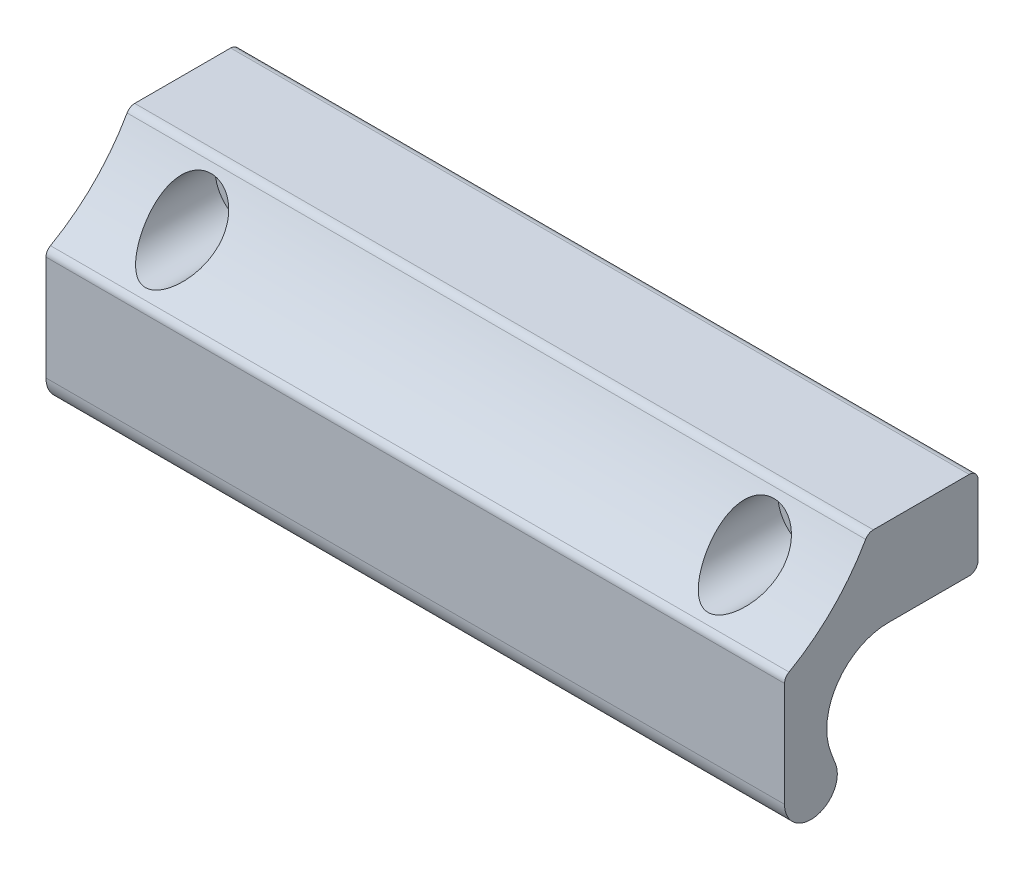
ISO-10303-21;
HEADER;
FILE_DESCRIPTION(('STEP AP214'),'2;1');
FILE_NAME('part.step','',(''),(''),'','','');
FILE_SCHEMA(('AUTOMOTIVE_DESIGN { 1 0 10303 214 1 1 1 1 }'));
ENDSEC;
DATA;
#1=APPLICATION_CONTEXT('core data for automotive mechanical design processes');
#2=APPLICATION_PROTOCOL_DEFINITION('international standard','automotive_design',2000,#1);
#3=PRODUCT_CONTEXT('',#1,'mechanical');
#4=PRODUCT('Part','Part','',(#3));
#5=PRODUCT_RELATED_PRODUCT_CATEGORY('part','',(#4));
#6=PRODUCT_DEFINITION_FORMATION('','',#4);
#7=PRODUCT_DEFINITION_CONTEXT('part definition',#1,'design');
#8=PRODUCT_DEFINITION('design','',#6,#7);
#9=PRODUCT_DEFINITION_SHAPE('','',#8);
#10=(LENGTH_UNIT() NAMED_UNIT(*) SI_UNIT(.MILLI.,.METRE.));
#11=(NAMED_UNIT(*) PLANE_ANGLE_UNIT() SI_UNIT($,.RADIAN.));
#12=(NAMED_UNIT(*) SI_UNIT($,.STERADIAN.) SOLID_ANGLE_UNIT());
#13=UNCERTAINTY_MEASURE_WITH_UNIT(LENGTH_MEASURE(1.E-05),#10,'distance_accuracy_value','');
#14=(GEOMETRIC_REPRESENTATION_CONTEXT(3) GLOBAL_UNCERTAINTY_ASSIGNED_CONTEXT((#13)) GLOBAL_UNIT_ASSIGNED_CONTEXT((#10,
#11,#12)) REPRESENTATION_CONTEXT('',''));
#15=CARTESIAN_POINT('',(0.,0.,0.));
#16=DIRECTION('',(0.,0.,1.));
#17=DIRECTION('',(1.,0.,0.));
#18=AXIS2_PLACEMENT_3D('',#15,#16,#17);
#19=CARTESIAN_POINT('',(-10.,15.8043402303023,32.8043402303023));
#20=DIRECTION('',(1.,0.,0.));
#21=DIRECTION('',(0.,1.,0.));
#22=AXIS2_PLACEMENT_3D('',#19,#20,#21);
#23=CYLINDRICAL_SURFACE('',#22,23.);
#24=CARTESIAN_POINT('',(67.75,0.,16.094378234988));
#25=CARTESIAN_POINT('',(67.7500006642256,-0.150169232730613,16.236409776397));
#26=CARTESIAN_POINT('',(67.7409857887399,-0.29845859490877,16.3805076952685));
#27=CARTESIAN_POINT('',(67.7061827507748,-0.590181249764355,16.6716960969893));
#28=CARTESIAN_POINT('',(67.6803814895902,-0.733610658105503,16.8187888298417));
#29=CARTESIAN_POINT('',(67.6128217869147,-1.01544237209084,17.1155863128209));
#30=CARTESIAN_POINT('',(67.5709823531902,-1.15381519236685,17.2653005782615));
#31=CARTESIAN_POINT('',(67.4720695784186,-1.42405592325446,17.5654707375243));
#32=CARTESIAN_POINT('',(67.4150003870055,-1.55592559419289,17.7159264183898));
#33=CARTESIAN_POINT('',(67.2849647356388,-1.81460439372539,18.0187712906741));
#34=CARTESIAN_POINT('',(67.2117670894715,-1.9413043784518,18.1711545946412));
#35=CARTESIAN_POINT('',(67.0498715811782,-2.1868769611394,18.4741574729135));
#36=CARTESIAN_POINT('',(66.9611662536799,-2.30574575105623,18.6247761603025));
#37=CARTESIAN_POINT('',(66.7681376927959,-2.53420019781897,18.9215160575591));
#38=CARTESIAN_POINT('',(66.6638971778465,-2.64383047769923,19.067656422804));
#39=CARTESIAN_POINT('',(66.4382918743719,-2.853229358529,19.3534526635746));
#40=CARTESIAN_POINT('',(66.316948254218,-2.95300989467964,19.493116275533));
#41=CARTESIAN_POINT('',(66.0789502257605,-3.12374564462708,19.7373761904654));
#42=CARTESIAN_POINT('',(65.965498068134,-3.19663498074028,19.8437139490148));
#43=CARTESIAN_POINT('',(65.7241156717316,-3.33304729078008,20.045999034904));
#44=CARTESIAN_POINT('',(65.5961684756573,-3.39655909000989,20.1419339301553));
#45=CARTESIAN_POINT('',(65.3222714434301,-3.51232726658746,20.3192407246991));
#46=CARTESIAN_POINT('',(65.1760841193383,-3.56440400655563,20.4003772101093));
#47=CARTESIAN_POINT('',(64.9451529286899,-3.62981593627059,20.5033135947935));
#48=CARTESIAN_POINT('',(64.8663403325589,-3.64948596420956,20.5344702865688));
#49=CARTESIAN_POINT('',(64.7051956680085,-3.68401760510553,20.5893923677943));
#50=CARTESIAN_POINT('',(64.6228662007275,-3.69888270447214,20.6131631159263));
#51=CARTESIAN_POINT('',(64.4293848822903,-3.72697994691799,20.658210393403));
#52=CARTESIAN_POINT('',(64.3172035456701,-3.73828046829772,20.6764343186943));
#53=CARTESIAN_POINT('',(64.0908651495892,-3.75060996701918,20.6963234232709));
#54=CARTESIAN_POINT('',(63.9767093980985,-3.75164550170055,20.6979991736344));
#55=CARTESIAN_POINT('',(63.7498794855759,-3.74336926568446,20.6846411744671));
#56=CARTESIAN_POINT('',(63.6372042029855,-3.73406584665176,20.669620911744));
#57=CARTESIAN_POINT('',(63.4161596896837,-3.70595298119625,20.6244737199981));
#58=CARTESIAN_POINT('',(63.307794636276,-3.68713454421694,20.5943325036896));
#59=CARTESIAN_POINT('',(63.0562251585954,-3.6323825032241,20.5072938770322));
#60=CARTESIAN_POINT('',(62.9158969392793,-3.59263719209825,20.4445472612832));
#61=CARTESIAN_POINT('',(62.6486494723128,-3.50092089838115,20.3017774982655));
#62=CARTESIAN_POINT('',(62.5217650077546,-3.44891927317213,20.2217110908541));
#63=CARTESIAN_POINT('',(62.303724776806,-3.34616134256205,20.0659999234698));
#64=CARTESIAN_POINT('',(62.2103375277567,-3.29701024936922,19.9923557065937));
#65=CARTESIAN_POINT('',(62.0314834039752,-3.19345122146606,19.839292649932));
#66=CARTESIAN_POINT('',(61.946021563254,-3.13903998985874,19.7598701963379));
#67=CARTESIAN_POINT('',(61.7823320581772,-3.02562036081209,19.5966727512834));
#68=CARTESIAN_POINT('',(61.704116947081,-2.96660430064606,19.5128905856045));
#69=CARTESIAN_POINT('',(61.554530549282,-2.84455534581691,19.3421814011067));
#70=CARTESIAN_POINT('',(61.4831614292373,-2.7815211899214,19.255253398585));
#71=CARTESIAN_POINT('',(61.3069800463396,-2.61388606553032,19.0275868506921));
#72=CARTESIAN_POINT('',(61.2070155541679,-2.5065324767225,18.8851063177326));
#73=CARTESIAN_POINT('',(61.022064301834,-2.28371602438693,18.5967547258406));
#74=CARTESIAN_POINT('',(60.9370856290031,-2.16824882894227,18.4508818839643));
#75=CARTESIAN_POINT('',(60.7815301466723,-1.92982538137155,18.1573214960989));
#76=CARTESIAN_POINT('',(60.710967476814,-1.80686192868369,18.0096323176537));
#77=CARTESIAN_POINT('',(60.5842889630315,-1.55415187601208,17.7139267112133));
#78=CARTESIAN_POINT('',(60.5281703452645,-1.42440658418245,17.565910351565));
#79=CARTESIAN_POINT('',(60.4294697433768,-1.15535678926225,17.2669625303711));
#80=CARTESIAN_POINT('',(60.3872582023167,-1.01589497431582,17.116049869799));
#81=CARTESIAN_POINT('',(60.3190319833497,-0.731044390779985,16.8160994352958));
#82=CARTESIAN_POINT('',(60.293019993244,-0.585654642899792,16.667061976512));
#83=CARTESIAN_POINT('',(60.25828003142,-0.290055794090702,16.3722410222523));
#84=CARTESIAN_POINT('',(60.2495221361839,-0.139855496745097,16.2264523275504));
#85=CARTESIAN_POINT('',(60.2505179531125,0.164377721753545,15.9391279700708));
#86=CARTESIAN_POINT('',(60.2602636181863,0.31840894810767,15.7975904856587));
#87=CARTESIAN_POINT('',(60.3079126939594,0.692581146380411,15.4630412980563));
#88=CARTESIAN_POINT('',(60.3557102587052,0.91397103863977,15.2726783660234));
#89=CARTESIAN_POINT('',(60.495799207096,1.35518812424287,14.9073062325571));
#90=CARTESIAN_POINT('',(60.5880264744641,1.57501710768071,14.7322753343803));
#91=CARTESIAN_POINT('',(60.7991197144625,1.96367364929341,14.4335970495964));
#92=CARTESIAN_POINT('',(60.9096629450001,2.13429131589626,14.3064889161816));
#93=CARTESIAN_POINT('',(61.1001727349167,2.37997450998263,14.1282393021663));
#94=CARTESIAN_POINT('',(61.1678322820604,2.46019965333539,14.0708656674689));
#95=CARTESIAN_POINT('',(61.3113580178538,2.616281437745,13.9606622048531));
#96=CARTESIAN_POINT('',(61.3872204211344,2.69214006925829,13.907830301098));
#97=CARTESIAN_POINT('',(61.5477452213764,2.83917333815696,13.806643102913));
#98=CARTESIAN_POINT('',(61.6324832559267,2.91029755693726,13.758334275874));
#99=CARTESIAN_POINT('',(61.8097619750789,3.04594886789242,13.6672003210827));
#100=CARTESIAN_POINT('',(61.902298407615,3.11047951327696,13.6243722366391));
#101=CARTESIAN_POINT('',(62.0946077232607,3.23185755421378,13.5445905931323));
#102=CARTESIAN_POINT('',(62.1943773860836,3.28870833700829,13.5076344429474));
#103=CARTESIAN_POINT('',(62.4004020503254,3.39369189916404,13.4399472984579));
#104=CARTESIAN_POINT('',(62.5066557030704,3.44182648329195,13.4092150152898));
#105=CARTESIAN_POINT('',(62.7083226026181,3.52193401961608,13.3584049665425));
#106=CARTESIAN_POINT('',(62.8029778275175,3.55524764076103,13.3374209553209));
#107=CARTESIAN_POINT('',(62.9955300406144,3.61437106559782,13.3003439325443));
#108=CARTESIAN_POINT('',(63.0934265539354,3.64018196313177,13.2842502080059));
#109=CARTESIAN_POINT('',(63.2915997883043,3.68387839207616,13.2570880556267));
#110=CARTESIAN_POINT('',(63.3918751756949,3.70176825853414,13.2460168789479));
#111=CARTESIAN_POINT('',(63.5939747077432,3.72934871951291,13.2289770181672));
#112=CARTESIAN_POINT('',(63.6957987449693,3.73903988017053,13.2230079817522));
#113=CARTESIAN_POINT('',(63.8896006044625,3.74949905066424,13.2165676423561));
#114=CARTESIAN_POINT('',(63.9815192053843,3.751079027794,13.2155960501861));
#115=CARTESIAN_POINT('',(64.1652063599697,3.7474856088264,13.2178075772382));
#116=CARTESIAN_POINT('',(64.2569748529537,3.74230994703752,13.2209920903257));
#117=CARTESIAN_POINT('',(64.439597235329,3.72527248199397,13.2314961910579));
#118=CARTESIAN_POINT('',(64.5304516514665,3.71341478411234,13.2388132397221));
#119=CARTESIAN_POINT('',(64.7106535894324,3.68318293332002,13.2575283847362));
#120=CARTESIAN_POINT('',(64.8000005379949,3.66480635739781,13.2689279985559));
#121=CARTESIAN_POINT('',(65.0615737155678,3.60101108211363,13.3086664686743));
#122=CARTESIAN_POINT('',(65.2308516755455,3.54658365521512,13.3427515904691));
#123=CARTESIAN_POINT('',(65.5568664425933,3.41607587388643,13.4255677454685));
#124=CARTESIAN_POINT('',(65.7136012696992,3.33999210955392,13.4743010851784));
#125=CARTESIAN_POINT('',(66.0192314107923,3.16508567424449,13.5881842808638));
#126=CARTESIAN_POINT('',(66.1672994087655,3.0652888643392,13.6540540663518));
#127=CARTESIAN_POINT('',(66.443829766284,2.84973334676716,13.7992083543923));
#128=CARTESIAN_POINT('',(66.5722875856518,2.73397095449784,13.8784959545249));
#129=CARTESIAN_POINT('',(66.8221710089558,2.47661423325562,14.0586987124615));
#130=CARTESIAN_POINT('',(66.9410681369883,2.33358067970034,14.1610543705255));
#131=CARTESIAN_POINT('',(67.1530779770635,2.03807613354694,14.378170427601));
#132=CARTESIAN_POINT('',(67.2461621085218,1.8855949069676,14.4929443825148));
#133=CARTESIAN_POINT('',(67.4441188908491,1.50504726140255,14.7873723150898));
#134=CARTESIAN_POINT('',(67.5350714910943,1.27416834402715,14.9727785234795));
#135=CARTESIAN_POINT('',(67.668890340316,0.812200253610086,15.3593785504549));
#136=CARTESIAN_POINT('',(67.7117581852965,0.581111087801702,15.5605718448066));
#137=CARTESIAN_POINT('',(67.7389347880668,0.293978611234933,15.8209607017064));
#138=CARTESIAN_POINT('',(67.7431071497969,0.234797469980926,15.8751995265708));
#139=CARTESIAN_POINT('',(67.7486383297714,0.116983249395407,15.9843147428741));
#140=CARTESIAN_POINT('',(67.7499997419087,0.0583497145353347,16.0391904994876));
#141=CARTESIAN_POINT('',(67.75,0.,16.094378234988));
#142=B_SPLINE_CURVE_WITH_KNOTS('',3,(#24,#25,#26,#27,#28,#29,#30,#31,#32,#33,#34,#35,#36,#37,
#38,#39,#40,#41,#42,#43,#44,#45,#46,#47,#48,#49,#50,#51,#52,#53,#54,#55,#56,#57,#58,#59,#60,#61,
#62,#63,#64,#65,#66,#67,#68,#69,#70,#71,#72,#73,#74,#75,#76,#77,#78,#79,#80,#81,#82,#83,#84,#85,
#86,#87,#88,#89,#90,#91,#92,#93,#94,#95,#96,#97,#98,#99,#100,#101,#102,#103,#104,#105,#106,#107,
#108,#109,#110,#111,#112,#113,#114,#115,#116,#117,#118,#119,#120,#121,#122,#123,#124,#125,#126,
#127,#128,#129,#130,#131,#132,#133,#134,#135,#136,#137,#138,#139,#140,#141),.UNSPECIFIED.,.T.,
.F.,(4,2,2,2,2,2,2,2,2,2,2,2,2,2,2,2,2,2,2,2,2,2,2,2,2,2,2,2,2,2,2,2,2,2,2,2,2,2,2,2,2,2,2,2,2,
2,2,2,2,2,2,2,2,2,2,2,2,2,4),(0.,0.620002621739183,1.24048962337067,1.8641522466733,
2.48764511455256,3.12073548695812,3.75413147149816,4.38426801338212,5.01363137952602,
5.52787354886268,6.04272365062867,6.5651600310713,6.82572511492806,7.08610070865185,
7.4271175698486,7.76791657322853,8.10844048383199,8.44928675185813,8.92293422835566,
9.39777869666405,9.78331644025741,10.1690974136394,10.5555346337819,10.9420937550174,
11.5546950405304,12.1676259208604,12.781155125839,13.3945664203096,14.0231985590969,
14.6519349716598,15.2795800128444,15.9069521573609,16.7911651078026,17.6741058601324,
18.3902630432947,18.7487042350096,19.1069807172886,19.4686065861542,19.8300365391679,
20.1913065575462,20.5525016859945,20.8596314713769,21.1667164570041,21.4736331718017,
21.7805286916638,22.0560044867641,22.3315726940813,22.606971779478,22.8824733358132,
23.422984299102,23.9635804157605,24.5321944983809,25.100940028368,25.7354158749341,
26.370591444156,27.2948858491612,28.2191495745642,28.4602802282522,28.7011882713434),.UNSPECIFIED.);
#143=CARTESIAN_POINT('',(67.75,0.,16.094378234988));
#144=VERTEX_POINT('',#143);
#145=EDGE_CURVE('E18',#144,#144,#142,.T.);
#146=ORIENTED_EDGE('',*,*,#145,.T.);
#147=EDGE_LOOP('',(#146));
#148=FACE_BOUND('',#147,.T.);
#149=CARTESIAN_POINT('',(3.75,0.,16.094378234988));
#150=CARTESIAN_POINT('',(3.75000066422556,-0.150169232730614,16.236409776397));
#151=CARTESIAN_POINT('',(3.74098578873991,-0.298458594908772,16.3805076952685));
#152=CARTESIAN_POINT('',(3.70618275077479,-0.590181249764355,16.6716960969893));
#153=CARTESIAN_POINT('',(3.68038148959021,-0.7336106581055,16.8187888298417));
#154=CARTESIAN_POINT('',(3.61282178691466,-1.01544237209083,17.1155863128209));
#155=CARTESIAN_POINT('',(3.57098235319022,-1.15381519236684,17.2653005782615));
#156=CARTESIAN_POINT('',(3.47206957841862,-1.42405592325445,17.5654707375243));
#157=CARTESIAN_POINT('',(3.41500038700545,-1.55592559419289,17.7159264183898));
#158=CARTESIAN_POINT('',(3.28496473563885,-1.81460439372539,18.0187712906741));
#159=CARTESIAN_POINT('',(3.21176708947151,-1.9413043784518,18.1711545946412));
#160=CARTESIAN_POINT('',(3.04987158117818,-2.1868769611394,18.4741574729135));
#161=CARTESIAN_POINT('',(2.96116625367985,-2.30574575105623,18.6247761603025));
#162=CARTESIAN_POINT('',(2.76813769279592,-2.53420019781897,18.9215160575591));
#163=CARTESIAN_POINT('',(2.66389717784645,-2.64383047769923,19.067656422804));
#164=CARTESIAN_POINT('',(2.43829187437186,-2.853229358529,19.3534526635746));
#165=CARTESIAN_POINT('',(2.31694825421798,-2.95300989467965,19.493116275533));
#166=CARTESIAN_POINT('',(2.07895022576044,-3.12374564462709,19.7373761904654));
#167=CARTESIAN_POINT('',(1.965498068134,-3.19663498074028,19.8437139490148));
#168=CARTESIAN_POINT('',(1.72411567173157,-3.33304729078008,20.045999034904));
#169=CARTESIAN_POINT('',(1.59616847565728,-3.3965590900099,20.1419339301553));
#170=CARTESIAN_POINT('',(1.32227144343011,-3.51232726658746,20.3192407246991));
#171=CARTESIAN_POINT('',(1.1760841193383,-3.56440400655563,20.4003772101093));
#172=CARTESIAN_POINT('',(0.945152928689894,-3.62981593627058,20.5033135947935));
#173=CARTESIAN_POINT('',(0.866340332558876,-3.64948596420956,20.5344702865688));
#174=CARTESIAN_POINT('',(0.705195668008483,-3.68401760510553,20.5893923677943));
#175=CARTESIAN_POINT('',(0.622866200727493,-3.69888270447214,20.6131631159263));
#176=CARTESIAN_POINT('',(0.429384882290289,-3.72697994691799,20.658210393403));
#177=CARTESIAN_POINT('',(0.317203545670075,-3.73828046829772,20.6764343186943));
#178=CARTESIAN_POINT('',(0.0908651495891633,-3.75060996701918,20.6963234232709));
#179=CARTESIAN_POINT('',(-0.0232906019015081,-3.75164550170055,20.6979991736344));
#180=CARTESIAN_POINT('',(-0.250120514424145,-3.74336926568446,20.6846411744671));
#181=CARTESIAN_POINT('',(-0.362795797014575,-3.73406584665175,20.669620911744));
#182=CARTESIAN_POINT('',(-0.583840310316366,-3.70595298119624,20.6244737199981));
#183=CARTESIAN_POINT('',(-0.692205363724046,-3.68713454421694,20.5943325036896));
#184=CARTESIAN_POINT('',(-0.943774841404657,-3.63238250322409,20.5072938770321));
#185=CARTESIAN_POINT('',(-1.08410306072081,-3.59263719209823,20.4445472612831));
#186=CARTESIAN_POINT('',(-1.35135052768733,-3.50092089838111,20.3017774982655));
#187=CARTESIAN_POINT('',(-1.47823499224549,-3.44891927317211,20.221711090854));
#188=CARTESIAN_POINT('',(-1.6962752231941,-3.34616134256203,20.0659999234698));
#189=CARTESIAN_POINT('',(-1.7896624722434,-3.29701024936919,19.9923557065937));
#190=CARTESIAN_POINT('',(-1.9685165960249,-3.19345122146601,19.839292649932));
#191=CARTESIAN_POINT('',(-2.0539784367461,-3.1390399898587,19.7598701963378));
#192=CARTESIAN_POINT('',(-2.21766794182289,-3.02562036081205,19.5966727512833));
#193=CARTESIAN_POINT('',(-2.29588305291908,-2.96660430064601,19.5128905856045));
#194=CARTESIAN_POINT('',(-2.44546945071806,-2.84455534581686,19.3421814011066));
#195=CARTESIAN_POINT('',(-2.51683857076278,-2.78152118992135,19.255253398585));
#196=CARTESIAN_POINT('',(-2.69301995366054,-2.61388606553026,19.0275868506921));
#197=CARTESIAN_POINT('',(-2.79298444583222,-2.50653247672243,18.8851063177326));
#198=CARTESIAN_POINT('',(-2.97793569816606,-2.28371602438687,18.5967547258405));
#199=CARTESIAN_POINT('',(-3.0629143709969,-2.1682488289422,18.4508818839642));
#200=CARTESIAN_POINT('',(-3.21846985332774,-1.92982538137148,18.1573214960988));
#201=CARTESIAN_POINT('',(-3.28903252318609,-1.80686192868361,18.0096323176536));
#202=CARTESIAN_POINT('',(-3.41571103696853,-1.554151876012,17.7139267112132));
#203=CARTESIAN_POINT('',(-3.47182965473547,-1.42440658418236,17.5659103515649));
#204=CARTESIAN_POINT('',(-3.57053025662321,-1.15535678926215,17.266962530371));
#205=CARTESIAN_POINT('',(-3.61274179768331,-1.01589497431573,17.1160498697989));
#206=CARTESIAN_POINT('',(-3.68096801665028,-0.731044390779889,16.8160994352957));
#207=CARTESIAN_POINT('',(-3.70698000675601,-0.585654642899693,16.6670619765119));
#208=CARTESIAN_POINT('',(-3.74171996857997,-0.290055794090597,16.3722410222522));
#209=CARTESIAN_POINT('',(-3.75047786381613,-0.13985549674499,16.2264523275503));
#210=CARTESIAN_POINT('',(-3.74948204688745,0.164377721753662,15.9391279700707));
#211=CARTESIAN_POINT('',(-3.73973638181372,0.318408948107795,15.7975904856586));
#212=CARTESIAN_POINT('',(-3.69208730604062,0.692581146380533,15.4630412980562));
#213=CARTESIAN_POINT('',(-3.64428974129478,0.913971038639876,15.2726783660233));
#214=CARTESIAN_POINT('',(-3.50420079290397,1.35518812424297,14.907306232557));
#215=CARTESIAN_POINT('',(-3.41197352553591,1.57501710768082,14.7322753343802));
#216=CARTESIAN_POINT('',(-3.20088028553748,1.9636736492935,14.4335970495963));
#217=CARTESIAN_POINT('',(-3.09033705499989,2.13429131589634,14.3064889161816));
#218=CARTESIAN_POINT('',(-2.89982726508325,2.3799745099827,14.1282393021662));
#219=CARTESIAN_POINT('',(-2.83216771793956,2.46019965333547,14.0708656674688));
#220=CARTESIAN_POINT('',(-2.68864198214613,2.61628143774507,13.9606622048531));
#221=CARTESIAN_POINT('',(-2.61277957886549,2.69214006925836,13.9078303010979));
#222=CARTESIAN_POINT('',(-2.45225477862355,2.83917333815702,13.806643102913));
#223=CARTESIAN_POINT('',(-2.36751674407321,2.91029755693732,13.758334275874));
#224=CARTESIAN_POINT('',(-2.19023802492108,3.04594886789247,13.6672003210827));
#225=CARTESIAN_POINT('',(-2.09770159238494,3.11047951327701,13.624372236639));
#226=CARTESIAN_POINT('',(-1.90539227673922,3.23185755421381,13.5445905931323));
#227=CARTESIAN_POINT('',(-1.80562261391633,3.28870833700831,13.5076344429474));
#228=CARTESIAN_POINT('',(-1.59959794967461,3.39369189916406,13.4399472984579));
#229=CARTESIAN_POINT('',(-1.49334429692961,3.44182648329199,13.4092150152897));
#230=CARTESIAN_POINT('',(-1.29167739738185,3.52193401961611,13.3584049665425));
#231=CARTESIAN_POINT('',(-1.19702217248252,3.55524764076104,13.3374209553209));
#232=CARTESIAN_POINT('',(-1.00446995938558,3.61437106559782,13.3003439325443));
#233=CARTESIAN_POINT('',(-0.906573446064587,3.64018196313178,13.2842502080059));
#234=CARTESIAN_POINT('',(-0.708400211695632,3.68387839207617,13.2570880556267));
#235=CARTESIAN_POINT('',(-0.608124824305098,3.70176825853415,13.2460168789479));
#236=CARTESIAN_POINT('',(-0.4060252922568,3.72934871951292,13.2289770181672));
#237=CARTESIAN_POINT('',(-0.304201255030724,3.73903988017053,13.2230079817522));
#238=CARTESIAN_POINT('',(-0.110399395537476,3.74949905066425,13.2165676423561));
#239=CARTESIAN_POINT('',(-0.018480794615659,3.751079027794,13.2155960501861));
#240=CARTESIAN_POINT('',(0.165206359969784,3.74748560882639,13.2178075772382));
#241=CARTESIAN_POINT('',(0.256974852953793,3.74230994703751,13.2209920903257));
#242=CARTESIAN_POINT('',(0.439597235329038,3.72527248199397,13.2314961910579));
#243=CARTESIAN_POINT('',(0.530451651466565,3.71341478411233,13.2388132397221));
#244=CARTESIAN_POINT('',(0.710653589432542,3.68318293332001,13.2575283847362));
#245=CARTESIAN_POINT('',(0.800000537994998,3.66480635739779,13.2689279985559));
#246=CARTESIAN_POINT('',(1.06157371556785,3.60101108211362,13.3086664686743));
#247=CARTESIAN_POINT('',(1.23085167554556,3.54658365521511,13.3427515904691));
#248=CARTESIAN_POINT('',(1.55686644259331,3.4160758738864,13.4255677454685));
#249=CARTESIAN_POINT('',(1.71360126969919,3.33999210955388,13.4743010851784));
#250=CARTESIAN_POINT('',(2.01923141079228,3.16508567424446,13.5881842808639));
#251=CARTESIAN_POINT('',(2.1672994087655,3.06528886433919,13.6540540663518));
#252=CARTESIAN_POINT('',(2.44382976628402,2.84973334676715,13.7992083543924));
#253=CARTESIAN_POINT('',(2.57228758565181,2.7339709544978,13.878495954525));
#254=CARTESIAN_POINT('',(2.82217100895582,2.47661423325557,14.0586987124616));
#255=CARTESIAN_POINT('',(2.94106813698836,2.3335806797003,14.1610543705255));
#256=CARTESIAN_POINT('',(3.15307797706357,2.03807613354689,14.378170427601));
#257=CARTESIAN_POINT('',(3.24616210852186,1.88559490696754,14.4929443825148));
#258=CARTESIAN_POINT('',(3.44411889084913,1.50504726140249,14.7873723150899));
#259=CARTESIAN_POINT('',(3.53507149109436,1.27416834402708,14.9727785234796));
#260=CARTESIAN_POINT('',(3.66889034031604,0.81220025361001,15.3593785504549));
#261=CARTESIAN_POINT('',(3.71175818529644,0.581111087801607,15.5605718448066));
#262=CARTESIAN_POINT('',(3.73893478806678,0.293978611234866,15.8209607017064));
#263=CARTESIAN_POINT('',(3.74310714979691,0.234797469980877,15.8751995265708));
#264=CARTESIAN_POINT('',(3.74863832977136,0.116983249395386,15.9843147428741));
#265=CARTESIAN_POINT('',(3.7499997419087,0.0583497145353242,16.0391904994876));
#266=CARTESIAN_POINT('',(3.75,0.,16.094378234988));
#267=B_SPLINE_CURVE_WITH_KNOTS('',3,(#149,#150,#151,#152,#153,#154,#155,#156,#157,#158,#159,
#160,#161,#162,#163,#164,#165,#166,#167,#168,#169,#170,#171,#172,#173,#174,#175,#176,#177,#178,
#179,#180,#181,#182,#183,#184,#185,#186,#187,#188,#189,#190,#191,#192,#193,#194,#195,#196,#197,
#198,#199,#200,#201,#202,#203,#204,#205,#206,#207,#208,#209,#210,#211,#212,#213,#214,#215,#216,
#217,#218,#219,#220,#221,#222,#223,#224,#225,#226,#227,#228,#229,#230,#231,#232,#233,#234,#235,
#236,#237,#238,#239,#240,#241,#242,#243,#244,#245,#246,#247,#248,#249,#250,#251,#252,#253,#254,
#255,#256,#257,#258,#259,#260,#261,#262,#263,#264,#265,#266),.UNSPECIFIED.,.T.,.F.,(4,2,2,2,2,2,
2,2,2,2,2,2,2,2,2,2,2,2,2,2,2,2,2,2,2,2,2,2,2,2,2,2,2,2,2,2,2,2,2,2,2,2,2,2,2,2,2,2,2,2,2,2,2,2,
2,2,2,2,4),(0.,0.62000262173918,1.24048962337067,1.8641522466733,2.48764511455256,
3.12073548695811,3.75413147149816,4.38426801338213,5.01363137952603,5.52787354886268,
6.04272365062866,6.5651600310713,6.82572511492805,7.08610070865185,7.42711756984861,
7.76791657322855,8.10844048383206,8.44928675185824,8.92293422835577,9.39777869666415,
9.78331644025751,10.1690974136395,10.555534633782,10.9420937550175,11.5546950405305,
12.1676259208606,12.7811551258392,13.3945664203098,14.0231985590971,14.65193497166,
15.2795800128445,15.9069521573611,16.7911651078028,17.6741058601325,18.3902630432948,
18.7487042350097,19.1069807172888,19.4686065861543,19.830036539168,20.1913065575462,
20.5525016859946,20.859631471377,21.1667164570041,21.4736331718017,21.7805286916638,
22.0560044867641,22.3315726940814,22.6069717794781,22.8824733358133,23.4229842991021,
23.9635804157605,24.532194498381,25.1009400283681,25.7354158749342,26.3705914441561,
27.2948858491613,28.2191495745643,28.4602802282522,28.7011882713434),.UNSPECIFIED.);
#268=CARTESIAN_POINT('',(3.75,0.,16.094378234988));
#269=VERTEX_POINT('',#268);
#270=EDGE_CURVE('E131',#269,#269,#267,.T.);
#271=ORIENTED_EDGE('',*,*,#270,.T.);
#272=EDGE_LOOP('',(#271));
#273=FACE_BOUND('',#272,.T.);
#274=DIRECTION('',(1.,0.,0.));
#275=VECTOR('',#274,1.);
#276=CARTESIAN_POINT('',(-10.,-4.22133100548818,21.4918475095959));
#277=LINE('',#276,#275);
#278=CARTESIAN_POINT('',(-10.,-4.22133100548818,21.4918475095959));
#279=VERTEX_POINT('',#278);
#280=CARTESIAN_POINT('',(74.,-4.22133100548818,21.4918475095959));
#281=VERTEX_POINT('',#280);
#282=EDGE_CURVE('E127',#279,#281,#277,.T.);
#283=ORIENTED_EDGE('',*,*,#282,.T.);
#284=CARTESIAN_POINT('',(74.,15.8043402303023,32.8043402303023));
#285=DIRECTION('',(1.,0.,0.));
#286=DIRECTION('',(0.,-1.,0.));
#287=AXIS2_PLACEMENT_3D('',#284,#285,#286);
#288=CIRCLE('',#287,23.);
#289=CARTESIAN_POINT('',(74.,4.49184750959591,12.7786689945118));
#290=VERTEX_POINT('',#289);
#291=EDGE_CURVE('E121',#281,#290,#288,.T.);
#292=ORIENTED_EDGE('',*,*,#291,.T.);
#293=DIRECTION('',(1.,0.,0.));
#294=VECTOR('',#293,1.);
#295=CARTESIAN_POINT('',(-10.,4.49184750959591,12.7786689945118));
#296=LINE('',#295,#294);
#297=CARTESIAN_POINT('',(-10.,4.49184750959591,12.7786689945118));
#298=VERTEX_POINT('',#297);
#299=EDGE_CURVE('E9',#298,#290,#296,.T.);
#300=ORIENTED_EDGE('',*,*,#299,.F.);
#301=CARTESIAN_POINT('',(-10.,15.8043402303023,32.8043402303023));
#302=DIRECTION('',(1.,0.,0.));
#303=DIRECTION('',(0.,-1.,0.));
#304=AXIS2_PLACEMENT_3D('',#301,#302,#303);
#305=CIRCLE('',#304,23.);
#306=EDGE_CURVE('E162',#279,#298,#305,.T.);
#307=ORIENTED_EDGE('',*,*,#306,.F.);
#308=EDGE_LOOP('',(#283,#292,#300,#307));
#309=FACE_BOUND('',#308,.T.);
#310=ADVANCED_FACE('F14',(#148,#273,#309),#23,.F.);
#311=CARTESIAN_POINT('',(-10.,4.,11.907987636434));
#312=DIRECTION('',(1.,0.,0.));
#313=DIRECTION('',(0.,1.,0.));
#314=AXIS2_PLACEMENT_3D('',#311,#312,#313);
#315=CYLINDRICAL_SURFACE('',#314,1.);
#316=ORIENTED_EDGE('',*,*,#299,.T.);
#317=CARTESIAN_POINT('',(74.,4.,11.907987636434));
#318=DIRECTION('',(-1.,0.,0.));
#319=DIRECTION('',(0.,-1.,0.));
#320=AXIS2_PLACEMENT_3D('',#317,#318,#319);
#321=CIRCLE('',#320,1.);
#322=CARTESIAN_POINT('',(74.,5.,11.907987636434));
#323=VERTEX_POINT('',#322);
#324=EDGE_CURVE('E111',#290,#323,#321,.T.);
#325=ORIENTED_EDGE('',*,*,#324,.T.);
#326=DIRECTION('',(1.,0.,0.));
#327=VECTOR('',#326,1.);
#328=CARTESIAN_POINT('',(-10.,5.,11.907987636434));
#329=LINE('',#328,#327);
#330=CARTESIAN_POINT('',(-10.,5.,11.907987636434));
#331=VERTEX_POINT('',#330);
#332=EDGE_CURVE('E27',#331,#323,#329,.T.);
#333=ORIENTED_EDGE('',*,*,#332,.F.);
#334=CARTESIAN_POINT('',(-10.,4.,11.907987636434));
#335=DIRECTION('',(-1.,0.,0.));
#336=DIRECTION('',(0.,-1.,0.));
#337=AXIS2_PLACEMENT_3D('',#334,#335,#336);
#338=CIRCLE('',#337,1.);
#339=EDGE_CURVE('E112',#298,#331,#338,.T.);
#340=ORIENTED_EDGE('',*,*,#339,.F.);
#341=EDGE_LOOP('',(#316,#325,#333,#340));
#342=FACE_BOUND('',#341,.T.);
#343=ADVANCED_FACE('F109',(#342),#315,.T.);
#344=CARTESIAN_POINT('',(-10.,5.,11.907987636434));
#345=DIRECTION('',(0.,-1.,0.));
#346=DIRECTION('',(1.,0.,0.));
#347=AXIS2_PLACEMENT_3D('',#344,#345,#346);
#348=PLANE('',#347);
#349=ORIENTED_EDGE('',*,*,#332,.T.);
#350=DIRECTION('',(0.,0.,-1.));
#351=VECTOR('',#350,1.);
#352=CARTESIAN_POINT('',(74.,5.,11.907987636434));
#353=LINE('',#352,#351);
#354=CARTESIAN_POINT('',(74.,5.,1.));
#355=VERTEX_POINT('',#354);
#356=EDGE_CURVE('E125',#323,#355,#353,.T.);
#357=ORIENTED_EDGE('',*,*,#356,.T.);
#358=DIRECTION('',(1.,0.,0.));
#359=VECTOR('',#358,1.);
#360=CARTESIAN_POINT('',(-10.,5.,1.));
#361=LINE('',#360,#359);
#362=CARTESIAN_POINT('',(-10.,5.,1.));
#363=VERTEX_POINT('',#362);
#364=EDGE_CURVE('E200',#363,#355,#361,.T.);
#365=ORIENTED_EDGE('',*,*,#364,.F.);
#366=DIRECTION('',(0.,0.,-1.));
#367=VECTOR('',#366,1.);
#368=CARTESIAN_POINT('',(-10.,5.,11.907987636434));
#369=LINE('',#368,#367);
#370=EDGE_CURVE('E165',#331,#363,#369,.T.);
#371=ORIENTED_EDGE('',*,*,#370,.F.);
#372=EDGE_LOOP('',(#349,#357,#365,#371));
#373=FACE_BOUND('',#372,.T.);
#374=ADVANCED_FACE('F265',(#373),#348,.F.);
#375=CARTESIAN_POINT('',(-10.,4.,1.));
#376=DIRECTION('',(1.,0.,0.));
#377=DIRECTION('',(0.,1.,0.));
#378=AXIS2_PLACEMENT_3D('',#375,#376,#377);
#379=CYLINDRICAL_SURFACE('',#378,1.);
#380=ORIENTED_EDGE('',*,*,#364,.T.);
#381=CARTESIAN_POINT('',(74.,4.,1.));
#382=DIRECTION('',(-1.,0.,0.));
#383=DIRECTION('',(0.,-1.,0.));
#384=AXIS2_PLACEMENT_3D('',#381,#382,#383);
#385=CIRCLE('',#384,1.);
#386=CARTESIAN_POINT('',(74.,4.,0.));
#387=VERTEX_POINT('',#386);
#388=EDGE_CURVE('E136',#355,#387,#385,.T.);
#389=ORIENTED_EDGE('',*,*,#388,.T.);
#390=DIRECTION('',(1.,0.,0.));
#391=VECTOR('',#390,1.);
#392=CARTESIAN_POINT('',(-10.,4.,0.));
#393=LINE('',#392,#391);
#394=CARTESIAN_POINT('',(-10.,4.,0.));
#395=VERTEX_POINT('',#394);
#396=EDGE_CURVE('E198',#395,#387,#393,.T.);
#397=ORIENTED_EDGE('',*,*,#396,.F.);
#398=CARTESIAN_POINT('',(-10.,4.,1.));
#399=DIRECTION('',(-1.,0.,0.));
#400=DIRECTION('',(0.,-1.,0.));
#401=AXIS2_PLACEMENT_3D('',#398,#399,#400);
#402=CIRCLE('',#401,1.);
#403=EDGE_CURVE('E167',#363,#395,#402,.T.);
#404=ORIENTED_EDGE('',*,*,#403,.F.);
#405=EDGE_LOOP('',(#380,#389,#397,#404));
#406=FACE_BOUND('',#405,.T.);
#407=ADVANCED_FACE('F261',(#406),#379,.T.);
#408=CARTESIAN_POINT('',(-10.,4.,0.));
#409=DIRECTION('',(0.,0.,1.));
#410=DIRECTION('',(-1.,0.,0.));
#411=AXIS2_PLACEMENT_3D('',#408,#409,#410);
#412=PLANE('',#411);
#413=CARTESIAN_POINT('',(64.,0.,0.));
#414=DIRECTION('',(0.,0.,-1.));
#415=DIRECTION('',(1.,0.,0.));
#416=AXIS2_PLACEMENT_3D('',#413,#414,#415);
#417=CIRCLE('',#416,2.25);
#418=CARTESIAN_POINT('',(66.25,0.,0.));
#419=VERTEX_POINT('',#418);
#420=EDGE_CURVE('E285',#419,#419,#417,.T.);
#421=ORIENTED_EDGE('',*,*,#420,.F.);
#422=EDGE_LOOP('',(#421));
#423=FACE_BOUND('',#422,.T.);
#424=CARTESIAN_POINT('',(0.,0.,0.));
#425=DIRECTION('',(0.,0.,-1.));
#426=DIRECTION('',(1.,0.,0.));
#427=AXIS2_PLACEMENT_3D('',#424,#425,#426);
#428=CIRCLE('',#427,2.25);
#429=CARTESIAN_POINT('',(2.25,0.,0.));
#430=VERTEX_POINT('',#429);
#431=EDGE_CURVE('E128',#430,#430,#428,.T.);
#432=ORIENTED_EDGE('',*,*,#431,.F.);
#433=EDGE_LOOP('',(#432));
#434=FACE_BOUND('',#433,.T.);
#435=ORIENTED_EDGE('',*,*,#396,.T.);
#436=DIRECTION('',(0.,-1.,0.));
#437=VECTOR('',#436,1.);
#438=CARTESIAN_POINT('',(74.,4.,0.));
#439=LINE('',#438,#437);
#440=CARTESIAN_POINT('',(74.,-4.,0.));
#441=VERTEX_POINT('',#440);
#442=EDGE_CURVE('E139',#387,#441,#439,.T.);
#443=ORIENTED_EDGE('',*,*,#442,.T.);
#444=DIRECTION('',(1.,0.,0.));
#445=VECTOR('',#444,1.);
#446=CARTESIAN_POINT('',(-10.,-4.,0.));
#447=LINE('',#446,#445);
#448=CARTESIAN_POINT('',(-10.,-4.,0.));
#449=VERTEX_POINT('',#448);
#450=EDGE_CURVE('E196',#449,#441,#447,.T.);
#451=ORIENTED_EDGE('',*,*,#450,.F.);
#452=DIRECTION('',(0.,-1.,0.));
#453=VECTOR('',#452,1.);
#454=CARTESIAN_POINT('',(-10.,4.,0.));
#455=LINE('',#454,#453);
#456=EDGE_CURVE('E169',#395,#449,#455,.T.);
#457=ORIENTED_EDGE('',*,*,#456,.F.);
#458=EDGE_LOOP('',(#435,#443,#451,#457));
#459=FACE_BOUND('',#458,.T.);
#460=ADVANCED_FACE('F257',(#423,#434,#459),#412,.F.);
#461=CARTESIAN_POINT('',(-10.,-4.,1.));
#462=DIRECTION('',(1.,0.,0.));
#463=DIRECTION('',(0.,1.,0.));
#464=AXIS2_PLACEMENT_3D('',#461,#462,#463);
#465=CYLINDRICAL_SURFACE('',#464,1.);
#466=ORIENTED_EDGE('',*,*,#450,.T.);
#467=CARTESIAN_POINT('',(74.,-4.,1.));
#468=DIRECTION('',(-1.,0.,0.));
#469=DIRECTION('',(0.,-1.,0.));
#470=AXIS2_PLACEMENT_3D('',#467,#468,#469);
#471=CIRCLE('',#470,1.);
#472=CARTESIAN_POINT('',(74.,-5.,1.));
#473=VERTEX_POINT('',#472);
#474=EDGE_CURVE('E142',#441,#473,#471,.T.);
#475=ORIENTED_EDGE('',*,*,#474,.T.);
#476=DIRECTION('',(1.,0.,0.));
#477=VECTOR('',#476,1.);
#478=CARTESIAN_POINT('',(-10.,-5.,1.));
#479=LINE('',#478,#477);
#480=CARTESIAN_POINT('',(-10.,-5.,1.));
#481=VERTEX_POINT('',#480);
#482=EDGE_CURVE('E194',#481,#473,#479,.T.);
#483=ORIENTED_EDGE('',*,*,#482,.F.);
#484=CARTESIAN_POINT('',(-10.,-4.,1.));
#485=DIRECTION('',(-1.,0.,0.));
#486=DIRECTION('',(0.,-1.,0.));
#487=AXIS2_PLACEMENT_3D('',#484,#485,#486);
#488=CIRCLE('',#487,1.);
#489=EDGE_CURVE('E171',#449,#481,#488,.T.);
#490=ORIENTED_EDGE('',*,*,#489,.F.);
#491=EDGE_LOOP('',(#466,#475,#483,#490));
#492=FACE_BOUND('',#491,.T.);
#493=ADVANCED_FACE('F253',(#492),#465,.T.);
#494=CARTESIAN_POINT('',(-10.,-5.,1.));
#495=DIRECTION('',(0.,1.,0.));
#496=DIRECTION('',(-1.,0.,0.));
#497=AXIS2_PLACEMENT_3D('',#494,#495,#496);
#498=PLANE('',#497);
#499=ORIENTED_EDGE('',*,*,#482,.T.);
#500=DIRECTION('',(0.,0.,1.));
#501=VECTOR('',#500,1.);
#502=CARTESIAN_POINT('',(74.,-5.,1.));
#503=LINE('',#502,#501);
#504=CARTESIAN_POINT('',(74.,-5.,10.2));
#505=VERTEX_POINT('',#504);
#506=EDGE_CURVE('E145',#473,#505,#503,.T.);
#507=ORIENTED_EDGE('',*,*,#506,.T.);
#508=DIRECTION('',(1.,0.,0.));
#509=VECTOR('',#508,1.);
#510=CARTESIAN_POINT('',(-10.,-5.,10.2));
#511=LINE('',#510,#509);
#512=CARTESIAN_POINT('',(-10.,-5.,10.2));
#513=VERTEX_POINT('',#512);
#514=EDGE_CURVE('E192',#513,#505,#511,.T.);
#515=ORIENTED_EDGE('',*,*,#514,.F.);
#516=DIRECTION('',(0.,0.,1.));
#517=VECTOR('',#516,1.);
#518=CARTESIAN_POINT('',(-10.,-5.,1.));
#519=LINE('',#518,#517);
#520=EDGE_CURVE('E173',#481,#513,#519,.T.);
#521=ORIENTED_EDGE('',*,*,#520,.F.);
#522=EDGE_LOOP('',(#499,#507,#515,#521));
#523=FACE_BOUND('',#522,.T.);
#524=ADVANCED_FACE('F249',(#523),#498,.F.);
#525=CARTESIAN_POINT('',(-10.,-12.,10.2));
#526=DIRECTION('',(1.,0.,0.));
#527=DIRECTION('',(0.,1.,0.));
#528=AXIS2_PLACEMENT_3D('',#525,#526,#527);
#529=CYLINDRICAL_SURFACE('',#528,7.);
#530=ORIENTED_EDGE('',*,*,#514,.T.);
#531=CARTESIAN_POINT('',(74.,-12.,10.2));
#532=DIRECTION('',(1.,0.,0.));
#533=DIRECTION('',(0.,-1.,0.));
#534=AXIS2_PLACEMENT_3D('',#531,#532,#533);
#535=CIRCLE('',#534,7.);
#536=CARTESIAN_POINT('',(74.,-14.4773303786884,16.7469713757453));
#537=VERTEX_POINT('',#536);
#538=EDGE_CURVE('E148',#505,#537,#535,.T.);
#539=ORIENTED_EDGE('',*,*,#538,.T.);
#540=DIRECTION('',(1.,0.,0.));
#541=VECTOR('',#540,1.);
#542=CARTESIAN_POINT('',(-10.,-14.4773303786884,16.7469713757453));
#543=LINE('',#542,#541);
#544=CARTESIAN_POINT('',(-10.,-14.4773303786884,16.7469713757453));
#545=VERTEX_POINT('',#544);
#546=EDGE_CURVE('E190',#545,#537,#543,.T.);
#547=ORIENTED_EDGE('',*,*,#546,.F.);
#548=CARTESIAN_POINT('',(-10.,-12.,10.2));
#549=DIRECTION('',(1.,0.,0.));
#550=DIRECTION('',(0.,-1.,0.));
#551=AXIS2_PLACEMENT_3D('',#548,#549,#550);
#552=CIRCLE('',#551,7.);
#553=EDGE_CURVE('E175',#513,#545,#552,.T.);
#554=ORIENTED_EDGE('',*,*,#553,.F.);
#555=EDGE_LOOP('',(#530,#539,#547,#554));
#556=FACE_BOUND('',#555,.T.);
#557=ADVANCED_FACE('F245',(#556),#529,.F.);
#558=CARTESIAN_POINT('',(-10.,-14.4773303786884,16.7469713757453));
#559=DIRECTION('',(0.,-0.353904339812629,0.935281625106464));
#560=DIRECTION('',(0.,0.935281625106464,0.353904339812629));
#561=AXIS2_PLACEMENT_3D('',#558,#559,#560);
#562=PLANE('',#561);
#563=ORIENTED_EDGE('',*,*,#546,.T.);
#564=DIRECTION('',(0.,-0.935281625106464,-0.353904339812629));
#565=VECTOR('',#564,1.);
#566=CARTESIAN_POINT('',(74.,-14.4773303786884,16.7469713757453));
#567=LINE('',#566,#565);
#568=CARTESIAN_POINT('',(74.,-15.9382869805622,16.1941551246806));
#569=VERTEX_POINT('',#568);
#570=EDGE_CURVE('E151',#537,#569,#567,.T.);
#571=ORIENTED_EDGE('',*,*,#570,.T.);
#572=DIRECTION('',(1.,0.,0.));
#573=VECTOR('',#572,1.);
#574=CARTESIAN_POINT('',(-10.,-15.9382869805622,16.1941551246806));
#575=LINE('',#574,#573);
#576=CARTESIAN_POINT('',(-10.,-15.9382869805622,16.1941551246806));
#577=VERTEX_POINT('',#576);
#578=EDGE_CURVE('E188',#577,#569,#575,.T.);
#579=ORIENTED_EDGE('',*,*,#578,.F.);
#580=DIRECTION('',(0.,-0.935281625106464,-0.353904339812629));
#581=VECTOR('',#580,1.);
#582=CARTESIAN_POINT('',(-10.,-14.4773303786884,16.7469713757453));
#583=LINE('',#582,#581);
#584=EDGE_CURVE('E177',#545,#577,#583,.T.);
#585=ORIENTED_EDGE('',*,*,#584,.F.);
#586=EDGE_LOOP('',(#563,#571,#579,#585));
#587=FACE_BOUND('',#586,.T.);
#588=ADVANCED_FACE('F241',(#587),#562,.F.);
#589=CARTESIAN_POINT('',(-10.,-17.,19.));
#590=DIRECTION('',(1.,0.,0.));
#591=DIRECTION('',(0.,1.,0.));
#592=AXIS2_PLACEMENT_3D('',#589,#590,#591);
#593=CYLINDRICAL_SURFACE('',#592,3.);
#594=ORIENTED_EDGE('',*,*,#578,.T.);
#595=CARTESIAN_POINT('',(74.,-17.,19.));
#596=DIRECTION('',(-1.,0.,0.));
#597=DIRECTION('',(0.,-1.,0.));
#598=AXIS2_PLACEMENT_3D('',#595,#596,#597);
#599=CIRCLE('',#598,3.);
#600=CARTESIAN_POINT('',(74.,-17.,22.));
#601=VERTEX_POINT('',#600);
#602=EDGE_CURVE('E154',#569,#601,#599,.T.);
#603=ORIENTED_EDGE('',*,*,#602,.T.);
#604=DIRECTION('',(1.,0.,0.));
#605=VECTOR('',#604,1.);
#606=CARTESIAN_POINT('',(-10.,-17.,22.));
#607=LINE('',#606,#605);
#608=CARTESIAN_POINT('',(-10.,-17.,22.));
#609=VERTEX_POINT('',#608);
#610=EDGE_CURVE('E186',#609,#601,#607,.T.);
#611=ORIENTED_EDGE('',*,*,#610,.F.);
#612=CARTESIAN_POINT('',(-10.,-17.,19.));
#613=DIRECTION('',(-1.,0.,0.));
#614=DIRECTION('',(0.,-1.,0.));
#615=AXIS2_PLACEMENT_3D('',#612,#613,#614);
#616=CIRCLE('',#615,3.);
#617=EDGE_CURVE('E179',#577,#609,#616,.T.);
#618=ORIENTED_EDGE('',*,*,#617,.F.);
#619=EDGE_LOOP('',(#594,#603,#611,#618));
#620=FACE_BOUND('',#619,.T.);
#621=ADVANCED_FACE('F237',(#620),#593,.T.);
#622=CARTESIAN_POINT('',(-10.,-17.,22.));
#623=DIRECTION('',(0.,0.,-1.));
#624=DIRECTION('',(1.,0.,0.));
#625=AXIS2_PLACEMENT_3D('',#622,#623,#624);
#626=PLANE('',#625);
#627=ORIENTED_EDGE('',*,*,#610,.T.);
#628=DIRECTION('',(0.,1.,0.));
#629=VECTOR('',#628,1.);
#630=CARTESIAN_POINT('',(74.,-17.,22.));
#631=LINE('',#630,#629);
#632=CARTESIAN_POINT('',(74.,-5.09201236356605,22.));
#633=VERTEX_POINT('',#632);
#634=EDGE_CURVE('E157',#601,#633,#631,.T.);
#635=ORIENTED_EDGE('',*,*,#634,.T.);
#636=DIRECTION('',(1.,0.,0.));
#637=VECTOR('',#636,1.);
#638=CARTESIAN_POINT('',(-10.,-5.09201236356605,22.));
#639=LINE('',#638,#637);
#640=CARTESIAN_POINT('',(-10.,-5.09201236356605,22.));
#641=VERTEX_POINT('',#640);
#642=EDGE_CURVE('E184',#641,#633,#639,.T.);
#643=ORIENTED_EDGE('',*,*,#642,.F.);
#644=DIRECTION('',(0.,1.,0.));
#645=VECTOR('',#644,1.);
#646=CARTESIAN_POINT('',(-10.,-17.,22.));
#647=LINE('',#646,#645);
#648=EDGE_CURVE('E40',#609,#641,#647,.T.);
#649=ORIENTED_EDGE('',*,*,#648,.F.);
#650=EDGE_LOOP('',(#627,#635,#643,#649));
#651=FACE_BOUND('',#650,.T.);
#652=ADVANCED_FACE('F233',(#651),#626,.F.);
#653=CARTESIAN_POINT('',(-10.,-5.09201236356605,21.));
#654=DIRECTION('',(1.,0.,0.));
#655=DIRECTION('',(0.,1.,0.));
#656=AXIS2_PLACEMENT_3D('',#653,#654,#655);
#657=CYLINDRICAL_SURFACE('',#656,1.00000000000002);
#658=ORIENTED_EDGE('',*,*,#642,.T.);
#659=CARTESIAN_POINT('',(74.,-5.09201236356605,21.));
#660=DIRECTION('',(-1.,0.,0.));
#661=DIRECTION('',(0.,-1.,0.));
#662=AXIS2_PLACEMENT_3D('',#659,#660,#661);
#663=CIRCLE('',#662,1.00000000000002);
#664=EDGE_CURVE('E160',#633,#281,#663,.T.);
#665=ORIENTED_EDGE('',*,*,#664,.T.);
#666=ORIENTED_EDGE('',*,*,#282,.F.);
#667=CARTESIAN_POINT('',(-10.,-5.09201236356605,21.));
#668=DIRECTION('',(-1.,0.,0.));
#669=DIRECTION('',(0.,-1.,0.));
#670=AXIS2_PLACEMENT_3D('',#667,#668,#669);
#671=CIRCLE('',#670,1.00000000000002);
#672=EDGE_CURVE('E35',#641,#279,#671,.T.);
#673=ORIENTED_EDGE('',*,*,#672,.F.);
#674=EDGE_LOOP('',(#658,#665,#666,#673));
#675=FACE_BOUND('',#674,.T.);
#676=ADVANCED_FACE('F230',(#675),#657,.T.);
#677=CARTESIAN_POINT('',(-10.,15.8043402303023,32.8043402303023));
#678=DIRECTION('',(-1.,0.,0.));
#679=DIRECTION('',(0.,-1.,0.));
#680=AXIS2_PLACEMENT_3D('',#677,#678,#679);
#681=PLANE('',#680);
#682=ORIENTED_EDGE('',*,*,#306,.T.);
#683=ORIENTED_EDGE('',*,*,#339,.T.);
#684=ORIENTED_EDGE('',*,*,#370,.T.);
#685=ORIENTED_EDGE('',*,*,#403,.T.);
#686=ORIENTED_EDGE('',*,*,#456,.T.);
#687=ORIENTED_EDGE('',*,*,#489,.T.);
#688=ORIENTED_EDGE('',*,*,#520,.T.);
#689=ORIENTED_EDGE('',*,*,#553,.T.);
#690=ORIENTED_EDGE('',*,*,#584,.T.);
#691=ORIENTED_EDGE('',*,*,#617,.T.);
#692=ORIENTED_EDGE('',*,*,#648,.T.);
#693=ORIENTED_EDGE('',*,*,#672,.T.);
#694=EDGE_LOOP('',(#682,#683,#684,#685,#686,#687,#688,#689,#690,#691,#692,#693));
#695=FACE_BOUND('',#694,.T.);
#696=ADVANCED_FACE('F227',(#695),#681,.T.);
#697=CARTESIAN_POINT('',(74.,15.8043402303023,32.8043402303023));
#698=DIRECTION('',(-1.,0.,0.));
#699=DIRECTION('',(0.,-1.,0.));
#700=AXIS2_PLACEMENT_3D('',#697,#698,#699);
#701=PLANE('',#700);
#702=ORIENTED_EDGE('',*,*,#291,.F.);
#703=ORIENTED_EDGE('',*,*,#664,.F.);
#704=ORIENTED_EDGE('',*,*,#634,.F.);
#705=ORIENTED_EDGE('',*,*,#602,.F.);
#706=ORIENTED_EDGE('',*,*,#570,.F.);
#707=ORIENTED_EDGE('',*,*,#538,.F.);
#708=ORIENTED_EDGE('',*,*,#506,.F.);
#709=ORIENTED_EDGE('',*,*,#474,.F.);
#710=ORIENTED_EDGE('',*,*,#442,.F.);
#711=ORIENTED_EDGE('',*,*,#388,.F.);
#712=ORIENTED_EDGE('',*,*,#356,.F.);
#713=ORIENTED_EDGE('',*,*,#324,.F.);
#714=EDGE_LOOP('',(#702,#703,#704,#705,#706,#707,#708,#709,#710,#711,#712,#713));
#715=FACE_BOUND('',#714,.T.);
#716=ADVANCED_FACE('F119',(#715),#701,.F.);
#717=CARTESIAN_POINT('',(0.,0.,22.));
#718=DIRECTION('',(0.,0.,-1.));
#719=DIRECTION('',(1.,0.,0.));
#720=AXIS2_PLACEMENT_3D('',#717,#718,#719);
#721=CYLINDRICAL_SURFACE('',#720,2.25);
#722=CARTESIAN_POINT('',(0.,0.,9.));
#723=DIRECTION('',(0.,0.,-1.));
#724=DIRECTION('',(1.,0.,0.));
#725=AXIS2_PLACEMENT_3D('',#722,#723,#724);
#726=CIRCLE('',#725,2.25);
#727=CARTESIAN_POINT('',(2.25,0.,9.));
#728=VERTEX_POINT('',#727);
#729=EDGE_CURVE('E203',#728,#728,#726,.F.);
#730=ORIENTED_EDGE('',*,*,#729,.T.);
#731=EDGE_LOOP('',(#730));
#732=FACE_BOUND('',#731,.T.);
#733=ORIENTED_EDGE('',*,*,#431,.T.);
#734=EDGE_LOOP('',(#733));
#735=FACE_BOUND('',#734,.T.);
#736=ADVANCED_FACE('F219',(#732,#735),#721,.F.);
#737=CARTESIAN_POINT('',(0.,0.,22.));
#738=DIRECTION('',(0.,0.,-1.));
#739=DIRECTION('',(1.,0.,0.));
#740=AXIS2_PLACEMENT_3D('',#737,#738,#739);
#741=CYLINDRICAL_SURFACE('',#740,3.75);
#742=CARTESIAN_POINT('',(0.,0.,9.));
#743=DIRECTION('',(0.,0.,-1.));
#744=DIRECTION('',(1.,0.,0.));
#745=AXIS2_PLACEMENT_3D('',#742,#743,#744);
#746=CIRCLE('',#745,3.75);
#747=CARTESIAN_POINT('',(3.75,0.,9.));
#748=VERTEX_POINT('',#747);
#749=EDGE_CURVE('E206',#748,#748,#746,.T.);
#750=ORIENTED_EDGE('',*,*,#749,.T.);
#751=EDGE_LOOP('',(#750));
#752=FACE_BOUND('',#751,.T.);
#753=ORIENTED_EDGE('',*,*,#270,.F.);
#754=EDGE_LOOP('',(#753));
#755=FACE_BOUND('',#754,.T.);
#756=ADVANCED_FACE('F213',(#752,#755),#741,.F.);
#757=CARTESIAN_POINT('',(0.,0.,9.));
#758=DIRECTION('',(0.,0.,-1.));
#759=DIRECTION('',(1.,0.,0.));
#760=AXIS2_PLACEMENT_3D('',#757,#758,#759);
#761=PLANE('',#760);
#762=ORIENTED_EDGE('',*,*,#749,.F.);
#763=EDGE_LOOP('',(#762));
#764=FACE_BOUND('',#763,.T.);
#765=ORIENTED_EDGE('',*,*,#729,.F.);
#766=EDGE_LOOP('',(#765));
#767=FACE_BOUND('',#766,.T.);
#768=ADVANCED_FACE('F218',(#764,#767),#761,.F.);
#769=CARTESIAN_POINT('',(64.,0.,22.));
#770=DIRECTION('',(0.,0.,-1.));
#771=DIRECTION('',(1.,0.,0.));
#772=AXIS2_PLACEMENT_3D('',#769,#770,#771);
#773=CYLINDRICAL_SURFACE('',#772,2.25);
#774=CARTESIAN_POINT('',(64.,0.,9.));
#775=DIRECTION('',(0.,0.,-1.));
#776=DIRECTION('',(1.,0.,0.));
#777=AXIS2_PLACEMENT_3D('',#774,#775,#776);
#778=CIRCLE('',#777,2.25);
#779=CARTESIAN_POINT('',(66.25,0.,9.));
#780=VERTEX_POINT('',#779);
#781=EDGE_CURVE('E212',#780,#780,#778,.F.);
#782=ORIENTED_EDGE('',*,*,#781,.T.);
#783=EDGE_LOOP('',(#782));
#784=FACE_BOUND('',#783,.T.);
#785=ORIENTED_EDGE('',*,*,#420,.T.);
#786=EDGE_LOOP('',(#785));
#787=FACE_BOUND('',#786,.T.);
#788=ADVANCED_FACE('F301',(#784,#787),#773,.F.);
#789=CARTESIAN_POINT('',(64.,0.,22.));
#790=DIRECTION('',(0.,0.,-1.));
#791=DIRECTION('',(1.,0.,0.));
#792=AXIS2_PLACEMENT_3D('',#789,#790,#791);
#793=CYLINDRICAL_SURFACE('',#792,3.75);
#794=CARTESIAN_POINT('',(64.,0.,9.));
#795=DIRECTION('',(0.,0.,-1.));
#796=DIRECTION('',(1.,0.,0.));
#797=AXIS2_PLACEMENT_3D('',#794,#795,#796);
#798=CIRCLE('',#797,3.75);
#799=CARTESIAN_POINT('',(67.75,0.,9.));
#800=VERTEX_POINT('',#799);
#801=EDGE_CURVE('E289',#800,#800,#798,.T.);
#802=ORIENTED_EDGE('',*,*,#801,.T.);
#803=EDGE_LOOP('',(#802));
#804=FACE_BOUND('',#803,.T.);
#805=ORIENTED_EDGE('',*,*,#145,.F.);
#806=EDGE_LOOP('',(#805));
#807=FACE_BOUND('',#806,.T.);
#808=ADVANCED_FACE('F334',(#804,#807),#793,.F.);
#809=CARTESIAN_POINT('',(64.,0.,9.));
#810=DIRECTION('',(0.,0.,-1.));
#811=DIRECTION('',(1.,0.,0.));
#812=AXIS2_PLACEMENT_3D('',#809,#810,#811);
#813=PLANE('',#812);
#814=ORIENTED_EDGE('',*,*,#801,.F.);
#815=EDGE_LOOP('',(#814));
#816=FACE_BOUND('',#815,.T.);
#817=ORIENTED_EDGE('',*,*,#781,.F.);
#818=EDGE_LOOP('',(#817));
#819=FACE_BOUND('',#818,.T.);
#820=ADVANCED_FACE('F339',(#816,#819),#813,.F.);
#821=CLOSED_SHELL('',(#310,#343,#374,#407,#460,#493,#524,#557,#588,#621,#652,#676,#696,#716,
#736,#756,#768,#788,#808,#820));
#822=MANIFOLD_SOLID_BREP('B1',#821);
#823=ADVANCED_BREP_SHAPE_REPRESENTATION('',(#18,#822),#14);
#824=SHAPE_DEFINITION_REPRESENTATION(#9,#823);
ENDSEC;
END-ISO-10303-21;
